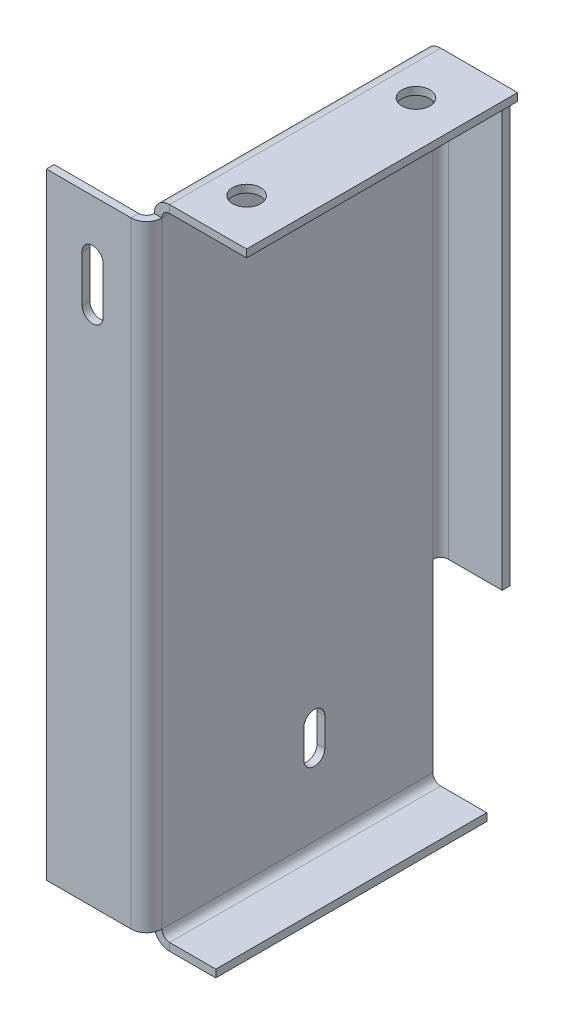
ISO-10303-21;
HEADER;
FILE_DESCRIPTION(('STEP AP214'),'2;1');
FILE_NAME('part.step','',(''),(''),'','','');
FILE_SCHEMA(('AUTOMOTIVE_DESIGN { 1 0 10303 214 1 1 1 1 }'));
ENDSEC;
DATA;
#1=APPLICATION_CONTEXT('core data for automotive mechanical design processes');
#2=APPLICATION_PROTOCOL_DEFINITION('international standard','automotive_design',2000,#1);
#3=PRODUCT_CONTEXT('',#1,'mechanical');
#4=PRODUCT('Part','Part','',(#3));
#5=PRODUCT_RELATED_PRODUCT_CATEGORY('part','',(#4));
#6=PRODUCT_DEFINITION_FORMATION('','',#4);
#7=PRODUCT_DEFINITION_CONTEXT('part definition',#1,'design');
#8=PRODUCT_DEFINITION('design','',#6,#7);
#9=PRODUCT_DEFINITION_SHAPE('','',#8);
#10=(LENGTH_UNIT() NAMED_UNIT(*) SI_UNIT(.MILLI.,.METRE.));
#11=(NAMED_UNIT(*) PLANE_ANGLE_UNIT() SI_UNIT($,.RADIAN.));
#12=(NAMED_UNIT(*) SI_UNIT($,.STERADIAN.) SOLID_ANGLE_UNIT());
#13=UNCERTAINTY_MEASURE_WITH_UNIT(LENGTH_MEASURE(1.E-05),#10,'distance_accuracy_value','');
#14=(GEOMETRIC_REPRESENTATION_CONTEXT(3) GLOBAL_UNCERTAINTY_ASSIGNED_CONTEXT((#13)) GLOBAL_UNIT_ASSIGNED_CONTEXT((#10,
#11,#12)) REPRESENTATION_CONTEXT('',''));
#15=CARTESIAN_POINT('',(0.,0.,0.));
#16=DIRECTION('',(0.,0.,1.));
#17=DIRECTION('',(1.,0.,0.));
#18=AXIS2_PLACEMENT_3D('',#15,#16,#17);
#19=CARTESIAN_POINT('',(0.,210.,88.));
#20=DIRECTION('',(0.,-1.,0.));
#21=DIRECTION('',(0.,0.,-1.));
#22=AXIS2_PLACEMENT_3D('',#19,#20,#21);
#23=PLANE('',#22);
#24=CARTESIAN_POINT('',(15.,210.,18.));
#25=DIRECTION('',(0.,1.,0.));
#26=DIRECTION('',(0.,0.,1.));
#27=AXIS2_PLACEMENT_3D('',#24,#25,#26);
#28=CIRCLE('',#27,4.54999999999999);
#29=CARTESIAN_POINT('',(15.,210.,22.55));
#30=VERTEX_POINT('',#29);
#31=EDGE_CURVE('E691',#30,#30,#28,.T.);
#32=ORIENTED_EDGE('',*,*,#31,.F.);
#33=EDGE_LOOP('',(#32));
#34=FACE_BOUND('',#33,.T.);
#35=DIRECTION('',(-0.999999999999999,0.,0.));
#36=VECTOR('',#35,1.);
#37=CARTESIAN_POINT('',(0.,210.,0.));
#38=LINE('',#37,#36);
#39=CARTESIAN_POINT('',(30.,210.,0.));
#40=VERTEX_POINT('',#39);
#41=CARTESIAN_POINT('',(5.,210.,0.));
#42=VERTEX_POINT('',#41);
#43=EDGE_CURVE('E514',#40,#42,#38,.T.);
#44=ORIENTED_EDGE('',*,*,#43,.T.);
#45=DIRECTION('',(0.,0.,-1.));
#46=VECTOR('',#45,1.);
#47=CARTESIAN_POINT('',(5.,210.,88.));
#48=LINE('',#47,#46);
#49=CARTESIAN_POINT('',(5.,210.,88.));
#50=VERTEX_POINT('',#49);
#51=EDGE_CURVE('E573',#50,#42,#48,.T.);
#52=ORIENTED_EDGE('',*,*,#51,.F.);
#53=DIRECTION('',(-0.999999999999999,0.,0.));
#54=VECTOR('',#53,1.);
#55=CARTESIAN_POINT('',(0.,210.,88.));
#56=LINE('',#55,#54);
#57=CARTESIAN_POINT('',(30.,210.,88.));
#58=VERTEX_POINT('',#57);
#59=EDGE_CURVE('E600',#58,#50,#56,.T.);
#60=ORIENTED_EDGE('',*,*,#59,.F.);
#61=DIRECTION('',(0.,0.,-1.));
#62=VECTOR('',#61,1.);
#63=CARTESIAN_POINT('',(30.,210.,88.));
#64=LINE('',#63,#62);
#65=EDGE_CURVE('E570',#58,#40,#64,.T.);
#66=ORIENTED_EDGE('',*,*,#65,.T.);
#67=EDGE_LOOP('',(#44,#52,#60,#66));
#68=FACE_BOUND('',#67,.T.);
#69=CARTESIAN_POINT('',(15.,210.,73.));
#70=DIRECTION('',(0.,1.,0.));
#71=DIRECTION('',(0.,0.,1.));
#72=AXIS2_PLACEMENT_3D('',#69,#70,#71);
#73=CIRCLE('',#72,4.54999999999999);
#74=CARTESIAN_POINT('',(15.,210.,77.55));
#75=VERTEX_POINT('',#74);
#76=EDGE_CURVE('E680',#75,#75,#73,.T.);
#77=ORIENTED_EDGE('',*,*,#76,.F.);
#78=EDGE_LOOP('',(#77));
#79=FACE_BOUND('',#78,.T.);
#80=ADVANCED_FACE('F80',(#34,#68,#79),#23,.F.);
#81=CARTESIAN_POINT('',(0.,5.,88.));
#82=DIRECTION('',(0.,0.,1.));
#83=DIRECTION('',(0.999999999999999,0.,0.));
#84=AXIS2_PLACEMENT_3D('',#81,#82,#83);
#85=PLANE('',#84);
#86=DIRECTION('',(0.999999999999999,0.,0.));
#87=VECTOR('',#86,1.);
#88=CARTESIAN_POINT('',(0.,5.,88.));
#89=LINE('',#88,#87);
#90=CARTESIAN_POINT('',(0.,5.,88.));
#91=VERTEX_POINT('',#90);
#92=CARTESIAN_POINT('',(2.49999999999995,5.,88.));
#93=VERTEX_POINT('',#92);
#94=EDGE_CURVE('E13',#91,#93,#89,.T.);
#95=ORIENTED_EDGE('',*,*,#94,.F.);
#96=CARTESIAN_POINT('',(4.99999999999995,5.,88.));
#97=DIRECTION('',(0.,0.,1.));
#98=DIRECTION('',(0.999999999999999,0.,0.));
#99=AXIS2_PLACEMENT_3D('',#96,#97,#98);
#100=CIRCLE('',#99,5.);
#101=CARTESIAN_POINT('',(4.99999999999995,0.,88.));
#102=VERTEX_POINT('',#101);
#103=EDGE_CURVE('E589',#91,#102,#100,.T.);
#104=ORIENTED_EDGE('',*,*,#103,.T.);
#105=DIRECTION('',(0.,-1.,0.));
#106=VECTOR('',#105,1.);
#107=CARTESIAN_POINT('',(4.99999999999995,2.49999999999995,88.));
#108=LINE('',#107,#106);
#109=CARTESIAN_POINT('',(4.99999999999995,2.49999999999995,88.));
#110=VERTEX_POINT('',#109);
#111=EDGE_CURVE('E90',#110,#102,#108,.T.);
#112=ORIENTED_EDGE('',*,*,#111,.F.);
#113=CARTESIAN_POINT('',(4.99999999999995,5.,88.));
#114=DIRECTION('',(0.,0.,1.));
#115=DIRECTION('',(0.999999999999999,0.,0.));
#116=AXIS2_PLACEMENT_3D('',#113,#114,#115);
#117=CIRCLE('',#116,2.5);
#118=EDGE_CURVE('E618',#93,#110,#117,.T.);
#119=ORIENTED_EDGE('',*,*,#118,.F.);
#120=EDGE_LOOP('',(#95,#104,#112,#119));
#121=FACE_BOUND('',#120,.T.);
#122=ADVANCED_FACE('F82',(#121),#85,.T.);
#123=CARTESIAN_POINT('',(4.99999999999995,0.,0.));
#124=DIRECTION('',(0.,0.,-1.));
#125=DIRECTION('',(-0.999999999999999,0.,0.));
#126=AXIS2_PLACEMENT_3D('',#123,#124,#125);
#127=PLANE('',#126);
#128=DIRECTION('',(0.,1.,0.));
#129=VECTOR('',#128,1.);
#130=CARTESIAN_POINT('',(4.99999999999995,0.,0.));
#131=LINE('',#130,#129);
#132=CARTESIAN_POINT('',(4.99999999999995,0.,0.));
#133=VERTEX_POINT('',#132);
#134=CARTESIAN_POINT('',(5.,2.49999999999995,0.));
#135=VERTEX_POINT('',#134);
#136=EDGE_CURVE('E530',#133,#135,#131,.T.);
#137=ORIENTED_EDGE('',*,*,#136,.F.);
#138=CARTESIAN_POINT('',(5.,5.,0.));
#139=DIRECTION('',(0.,0.,1.));
#140=DIRECTION('',(0.999999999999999,0.,0.));
#141=AXIS2_PLACEMENT_3D('',#138,#139,#140);
#142=CIRCLE('',#141,5.);
#143=CARTESIAN_POINT('',(0.,5.,0.));
#144=VERTEX_POINT('',#143);
#145=EDGE_CURVE('E523',#144,#133,#142,.T.);
#146=ORIENTED_EDGE('',*,*,#145,.F.);
#147=DIRECTION('',(-0.999999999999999,0.,0.));
#148=VECTOR('',#147,1.);
#149=CARTESIAN_POINT('',(2.5,5.,0.));
#150=LINE('',#149,#148);
#151=CARTESIAN_POINT('',(2.5,5.,0.));
#152=VERTEX_POINT('',#151);
#153=EDGE_CURVE('E533',#152,#144,#150,.T.);
#154=ORIENTED_EDGE('',*,*,#153,.F.);
#155=CARTESIAN_POINT('',(5.,5.,0.));
#156=DIRECTION('',(0.,0.,1.));
#157=DIRECTION('',(0.999999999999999,0.,0.));
#158=AXIS2_PLACEMENT_3D('',#155,#156,#157);
#159=CIRCLE('',#158,2.5);
#160=EDGE_CURVE('E489',#152,#135,#159,.T.);
#161=ORIENTED_EDGE('',*,*,#160,.T.);
#162=EDGE_LOOP('',(#137,#146,#154,#161));
#163=FACE_BOUND('',#162,.T.);
#164=ADVANCED_FACE('F713',(#163),#127,.T.);
#165=CARTESIAN_POINT('',(2.5,5.,0.));
#166=DIRECTION('',(0.,0.,-1.));
#167=DIRECTION('',(-0.999999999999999,0.,0.));
#168=AXIS2_PLACEMENT_3D('',#165,#166,#167);
#169=PLANE('',#168);
#170=DIRECTION('',(0.999999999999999,0.,0.));
#171=VECTOR('',#170,1.);
#172=CARTESIAN_POINT('',(0.,0.,0.));
#173=LINE('',#172,#171);
#174=CARTESIAN_POINT('',(20.,0.,0.));
#175=VERTEX_POINT('',#174);
#176=EDGE_CURVE('E687',#133,#175,#173,.T.);
#177=ORIENTED_EDGE('',*,*,#176,.F.);
#178=ORIENTED_EDGE('',*,*,#136,.T.);
#179=DIRECTION('',(0.999999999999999,0.,0.));
#180=VECTOR('',#179,1.);
#181=CARTESIAN_POINT('',(0.,2.49999999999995,0.));
#182=LINE('',#181,#180);
#183=CARTESIAN_POINT('',(20.,2.49999999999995,0.));
#184=VERTEX_POINT('',#183);
#185=EDGE_CURVE('E494',#135,#184,#182,.T.);
#186=ORIENTED_EDGE('',*,*,#185,.T.);
#187=DIRECTION('',(0.,-1.,0.));
#188=VECTOR('',#187,1.);
#189=CARTESIAN_POINT('',(20.,2.49999999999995,0.));
#190=LINE('',#189,#188);
#191=EDGE_CURVE('E698',#184,#175,#190,.T.);
#192=ORIENTED_EDGE('',*,*,#191,.T.);
#193=EDGE_LOOP('',(#177,#178,#186,#192));
#194=FACE_BOUND('',#193,.T.);
#195=ADVANCED_FACE('F706',(#194),#169,.T.);
#196=CARTESIAN_POINT('',(5.,210.,88.));
#197=DIRECTION('',(0.,0.,1.));
#198=DIRECTION('',(0.999999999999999,0.,0.));
#199=AXIS2_PLACEMENT_3D('',#196,#197,#198);
#200=PLANE('',#199);
#201=DIRECTION('',(0.,-1.,0.));
#202=VECTOR('',#201,1.);
#203=CARTESIAN_POINT('',(5.,210.,88.));
#204=LINE('',#203,#202);
#205=CARTESIAN_POINT('',(5.,207.5,88.));
#206=VERTEX_POINT('',#205);
#207=EDGE_CURVE('E536',#50,#206,#204,.T.);
#208=ORIENTED_EDGE('',*,*,#207,.F.);
#209=CARTESIAN_POINT('',(5.,205.,88.));
#210=DIRECTION('',(0.,0.,1.));
#211=DIRECTION('',(0.999999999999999,0.,0.));
#212=AXIS2_PLACEMENT_3D('',#209,#210,#211);
#213=CIRCLE('',#212,5.);
#214=CARTESIAN_POINT('',(0.,205.,88.));
#215=VERTEX_POINT('',#214);
#216=EDGE_CURVE('E596',#50,#215,#213,.T.);
#217=ORIENTED_EDGE('',*,*,#216,.T.);
#218=DIRECTION('',(-0.999999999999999,0.,0.));
#219=VECTOR('',#218,1.);
#220=CARTESIAN_POINT('',(2.5,205.,88.));
#221=LINE('',#220,#219);
#222=CARTESIAN_POINT('',(2.5,205.,88.));
#223=VERTEX_POINT('',#222);
#224=EDGE_CURVE('E539',#223,#215,#221,.T.);
#225=ORIENTED_EDGE('',*,*,#224,.F.);
#226=CARTESIAN_POINT('',(5.,205.,88.));
#227=DIRECTION('',(0.,0.,1.));
#228=DIRECTION('',(0.999999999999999,0.,0.));
#229=AXIS2_PLACEMENT_3D('',#226,#227,#228);
#230=CIRCLE('',#229,2.5);
#231=EDGE_CURVE('E611',#206,#223,#230,.T.);
#232=ORIENTED_EDGE('',*,*,#231,.F.);
#233=EDGE_LOOP('',(#208,#217,#225,#232));
#234=FACE_BOUND('',#233,.T.);
#235=ADVANCED_FACE('F738',(#234),#200,.T.);
#236=CARTESIAN_POINT('',(2.5,205.,88.));
#237=DIRECTION('',(0.,0.,1.));
#238=DIRECTION('',(0.999999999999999,0.,0.));
#239=AXIS2_PLACEMENT_3D('',#236,#237,#238);
#240=PLANE('',#239);
#241=ORIENTED_EDGE('',*,*,#59,.T.);
#242=ORIENTED_EDGE('',*,*,#207,.T.);
#243=DIRECTION('',(0.999999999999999,0.,0.));
#244=VECTOR('',#243,1.);
#245=CARTESIAN_POINT('',(0.,207.5,88.));
#246=LINE('',#245,#244);
#247=CARTESIAN_POINT('',(30.,207.5,88.));
#248=VERTEX_POINT('',#247);
#249=EDGE_CURVE('E608',#248,#206,#246,.F.);
#250=ORIENTED_EDGE('',*,*,#249,.F.);
#251=DIRECTION('',(0.,-1.,0.));
#252=VECTOR('',#251,1.);
#253=CARTESIAN_POINT('',(30.,210.,88.));
#254=LINE('',#253,#252);
#255=EDGE_CURVE('E604',#58,#248,#254,.T.);
#256=ORIENTED_EDGE('',*,*,#255,.F.);
#257=EDGE_LOOP('',(#241,#242,#250,#256));
#258=FACE_BOUND('',#257,.T.);
#259=ADVANCED_FACE('F669',(#258),#240,.T.);
#260=CARTESIAN_POINT('',(0.,205.,0.));
#261=DIRECTION('',(0.,0.,-1.));
#262=DIRECTION('',(-0.999999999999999,0.,0.));
#263=AXIS2_PLACEMENT_3D('',#260,#261,#262);
#264=PLANE('',#263);
#265=DIRECTION('',(0.999999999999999,0.,0.));
#266=VECTOR('',#265,1.);
#267=CARTESIAN_POINT('',(0.,205.,0.));
#268=LINE('',#267,#266);
#269=CARTESIAN_POINT('',(0.,205.,0.));
#270=VERTEX_POINT('',#269);
#271=CARTESIAN_POINT('',(2.5,205.,0.));
#272=VERTEX_POINT('',#271);
#273=EDGE_CURVE('E542',#270,#272,#268,.T.);
#274=ORIENTED_EDGE('',*,*,#273,.F.);
#275=CARTESIAN_POINT('',(5.,205.,0.));
#276=DIRECTION('',(0.,0.,1.));
#277=DIRECTION('',(0.999999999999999,0.,0.));
#278=AXIS2_PLACEMENT_3D('',#275,#276,#277);
#279=CIRCLE('',#278,5.);
#280=EDGE_CURVE('E518',#42,#270,#279,.T.);
#281=ORIENTED_EDGE('',*,*,#280,.F.);
#282=DIRECTION('',(0.,1.,0.));
#283=VECTOR('',#282,1.);
#284=CARTESIAN_POINT('',(5.,207.5,0.));
#285=LINE('',#284,#283);
#286=CARTESIAN_POINT('',(5.,207.5,0.));
#287=VERTEX_POINT('',#286);
#288=EDGE_CURVE('E545',#287,#42,#285,.T.);
#289=ORIENTED_EDGE('',*,*,#288,.F.);
#290=CARTESIAN_POINT('',(5.,205.,0.));
#291=DIRECTION('',(0.,0.,1.));
#292=DIRECTION('',(0.999999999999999,0.,0.));
#293=AXIS2_PLACEMENT_3D('',#290,#291,#292);
#294=CIRCLE('',#293,2.5);
#295=EDGE_CURVE('E491',#287,#272,#294,.T.);
#296=ORIENTED_EDGE('',*,*,#295,.T.);
#297=EDGE_LOOP('',(#274,#281,#289,#296));
#298=FACE_BOUND('',#297,.T.);
#299=ADVANCED_FACE('F653',(#298),#264,.T.);
#300=CARTESIAN_POINT('',(5.,207.5,0.));
#301=DIRECTION('',(0.,0.,-1.));
#302=DIRECTION('',(-0.999999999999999,0.,0.));
#303=AXIS2_PLACEMENT_3D('',#300,#301,#302);
#304=PLANE('',#303);
#305=DIRECTION('',(-0.999999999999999,0.,0.));
#306=VECTOR('',#305,1.);
#307=CARTESIAN_POINT('',(2.49999999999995,64.9999999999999,0.));
#308=LINE('',#307,#306);
#309=CARTESIAN_POINT('',(2.5,64.9999999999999,0.));
#310=VERTEX_POINT('',#309);
#311=CARTESIAN_POINT('',(0.,64.9999999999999,0.));
#312=VERTEX_POINT('',#311);
#313=EDGE_CURVE('E421',#310,#312,#308,.T.);
#314=ORIENTED_EDGE('',*,*,#313,.F.);
#315=DIRECTION('',(0.,1.,0.));
#316=VECTOR('',#315,1.);
#317=CARTESIAN_POINT('',(2.49999999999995,0.,0.));
#318=LINE('',#317,#316);
#319=EDGE_CURVE('E478',#310,#152,#318,.F.);
#320=ORIENTED_EDGE('',*,*,#319,.T.);
#321=ORIENTED_EDGE('',*,*,#153,.T.);
#322=DIRECTION('',(0.,-1.,0.));
#323=VECTOR('',#322,1.);
#324=CARTESIAN_POINT('',(0.,0.,0.));
#325=LINE('',#324,#323);
#326=EDGE_CURVE('E480',#312,#144,#325,.T.);
#327=ORIENTED_EDGE('',*,*,#326,.F.);
#328=EDGE_LOOP('',(#314,#320,#321,#327));
#329=FACE_BOUND('',#328,.T.);
#330=ADVANCED_FACE('F476',(#329),#304,.T.);
#331=CARTESIAN_POINT('',(0.,0.,88.));
#332=DIRECTION('',(0.,1.,0.));
#333=DIRECTION('',(0.,0.,1.));
#334=AXIS2_PLACEMENT_3D('',#331,#332,#333);
#335=PLANE('',#334);
#336=ORIENTED_EDGE('',*,*,#176,.T.);
#337=DIRECTION('',(0.,0.,-1.));
#338=VECTOR('',#337,1.);
#339=CARTESIAN_POINT('',(19.9999999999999,0.,88.));
#340=LINE('',#339,#338);
#341=CARTESIAN_POINT('',(19.9999999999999,0.,88.));
#342=VERTEX_POINT('',#341);
#343=EDGE_CURVE('E548',#342,#175,#340,.T.);
#344=ORIENTED_EDGE('',*,*,#343,.F.);
#345=DIRECTION('',(0.999999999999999,0.,0.));
#346=VECTOR('',#345,1.);
#347=CARTESIAN_POINT('',(0.,0.,88.));
#348=LINE('',#347,#346);
#349=EDGE_CURVE('E628',#102,#342,#348,.T.);
#350=ORIENTED_EDGE('',*,*,#349,.F.);
#351=DIRECTION('',(0.,0.,-1.));
#352=VECTOR('',#351,1.);
#353=CARTESIAN_POINT('',(4.99999999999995,0.,88.));
#354=LINE('',#353,#352);
#355=EDGE_CURVE('E585',#102,#133,#354,.T.);
#356=ORIENTED_EDGE('',*,*,#355,.T.);
#357=EDGE_LOOP('',(#336,#344,#350,#356));
#358=FACE_BOUND('',#357,.T.);
#359=ADVANCED_FACE('F807',(#358),#335,.F.);
#360=CARTESIAN_POINT('',(19.9999999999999,2.49999999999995,88.));
#361=DIRECTION('',(0.999999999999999,0.,0.));
#362=DIRECTION('',(0.,0.,-1.));
#363=AXIS2_PLACEMENT_3D('',#360,#361,#362);
#364=PLANE('',#363);
#365=ORIENTED_EDGE('',*,*,#191,.F.);
#366=DIRECTION('',(0.,0.,-1.));
#367=VECTOR('',#366,1.);
#368=CARTESIAN_POINT('',(19.9999999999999,2.49999999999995,88.));
#369=LINE('',#368,#367);
#370=CARTESIAN_POINT('',(19.9999999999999,2.49999999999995,88.));
#371=VERTEX_POINT('',#370);
#372=EDGE_CURVE('E551',#371,#184,#369,.T.);
#373=ORIENTED_EDGE('',*,*,#372,.F.);
#374=DIRECTION('',(0.,-1.,0.));
#375=VECTOR('',#374,1.);
#376=CARTESIAN_POINT('',(19.9999999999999,2.49999999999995,88.));
#377=LINE('',#376,#375);
#378=EDGE_CURVE('E625',#371,#342,#377,.T.);
#379=ORIENTED_EDGE('',*,*,#378,.T.);
#380=ORIENTED_EDGE('',*,*,#343,.T.);
#381=EDGE_LOOP('',(#365,#373,#379,#380));
#382=FACE_BOUND('',#381,.T.);
#383=ADVANCED_FACE('F817',(#382),#364,.T.);
#384=CARTESIAN_POINT('',(0.,2.49999999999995,88.));
#385=DIRECTION('',(0.,1.,0.));
#386=DIRECTION('',(0.,0.,1.));
#387=AXIS2_PLACEMENT_3D('',#384,#385,#386);
#388=PLANE('',#387);
#389=ORIENTED_EDGE('',*,*,#185,.F.);
#390=DIRECTION('',(0.,0.,-1.));
#391=VECTOR('',#390,1.);
#392=CARTESIAN_POINT('',(4.99999999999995,2.49999999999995,88.));
#393=LINE('',#392,#391);
#394=EDGE_CURVE('E554',#110,#135,#393,.T.);
#395=ORIENTED_EDGE('',*,*,#394,.F.);
#396=DIRECTION('',(0.999999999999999,0.,0.));
#397=VECTOR('',#396,1.);
#398=CARTESIAN_POINT('',(0.,2.49999999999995,88.));
#399=LINE('',#398,#397);
#400=EDGE_CURVE('E622',#110,#371,#399,.T.);
#401=ORIENTED_EDGE('',*,*,#400,.T.);
#402=ORIENTED_EDGE('',*,*,#372,.T.);
#403=EDGE_LOOP('',(#389,#395,#401,#402));
#404=FACE_BOUND('',#403,.T.);
#405=ADVANCED_FACE('F710',(#404),#388,.T.);
#406=CARTESIAN_POINT('',(4.99999999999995,5.,88.));
#407=DIRECTION('',(0.,0.,-1.));
#408=DIRECTION('',(-0.999999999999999,0.,0.));
#409=AXIS2_PLACEMENT_3D('',#406,#407,#408);
#410=CYLINDRICAL_SURFACE('',#409,2.5);
#411=ORIENTED_EDGE('',*,*,#160,.F.);
#412=DIRECTION('',(0.,0.,-1.));
#413=VECTOR('',#412,1.);
#414=CARTESIAN_POINT('',(2.49999999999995,5.,88.));
#415=LINE('',#414,#413);
#416=EDGE_CURVE('E486',#93,#152,#415,.T.);
#417=ORIENTED_EDGE('',*,*,#416,.F.);
#418=ORIENTED_EDGE('',*,*,#118,.T.);
#419=ORIENTED_EDGE('',*,*,#394,.T.);
#420=EDGE_LOOP('',(#411,#417,#418,#419));
#421=FACE_BOUND('',#420,.T.);
#422=ADVANCED_FACE('F715',(#421),#410,.F.);
#423=CARTESIAN_POINT('',(2.49999999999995,0.,88.));
#424=DIRECTION('',(0.999999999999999,0.,0.));
#425=DIRECTION('',(0.,0.,-1.));
#426=AXIS2_PLACEMENT_3D('',#423,#424,#425);
#427=PLANE('',#426);
#428=CARTESIAN_POINT('',(2.5,38.6,38.5));
#429=DIRECTION('',(0.999999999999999,0.,0.));
#430=DIRECTION('',(0.,0.,-1.));
#431=AXIS2_PLACEMENT_3D('',#428,#429,#430);
#432=CIRCLE('',#431,3.4);
#433=CARTESIAN_POINT('',(2.5,38.6,41.9));
#434=VERTEX_POINT('',#433);
#435=CARTESIAN_POINT('',(2.5,38.6,35.1));
#436=VERTEX_POINT('',#435);
#437=EDGE_CURVE('E285',#434,#436,#432,.F.);
#438=ORIENTED_EDGE('',*,*,#437,.T.);
#439=DIRECTION('',(0.,-1.,0.));
#440=VECTOR('',#439,1.);
#441=CARTESIAN_POINT('',(2.5,38.6,35.1));
#442=LINE('',#441,#440);
#443=CARTESIAN_POINT('',(2.5,29.4,35.1));
#444=VERTEX_POINT('',#443);
#445=EDGE_CURVE('E273',#436,#444,#442,.T.);
#446=ORIENTED_EDGE('',*,*,#445,.T.);
#447=CARTESIAN_POINT('',(2.5,29.4,38.5));
#448=DIRECTION('',(0.999999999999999,0.,0.));
#449=DIRECTION('',(0.,0.,-1.));
#450=AXIS2_PLACEMENT_3D('',#447,#448,#449);
#451=CIRCLE('',#450,3.4);
#452=CARTESIAN_POINT('',(2.5,29.4,41.9));
#453=VERTEX_POINT('',#452);
#454=EDGE_CURVE('E302',#444,#453,#451,.F.);
#455=ORIENTED_EDGE('',*,*,#454,.T.);
#456=DIRECTION('',(0.,1.,0.));
#457=VECTOR('',#456,1.);
#458=CARTESIAN_POINT('',(2.5,38.6,41.9));
#459=LINE('',#458,#457);
#460=EDGE_CURVE('E293',#453,#434,#459,.T.);
#461=ORIENTED_EDGE('',*,*,#460,.T.);
#462=EDGE_LOOP('',(#438,#446,#455,#461));
#463=FACE_BOUND('',#462,.T.);
#464=EDGE_CURVE('E427',#272,#310,#318,.F.);
#465=ORIENTED_EDGE('',*,*,#464,.F.);
#466=DIRECTION('',(0.,0.,-1.));
#467=VECTOR('',#466,1.);
#468=CARTESIAN_POINT('',(2.5,205.,88.));
#469=LINE('',#468,#467);
#470=EDGE_CURVE('E560',#223,#272,#469,.T.);
#471=ORIENTED_EDGE('',*,*,#470,.F.);
#472=DIRECTION('',(0.,1.,0.));
#473=VECTOR('',#472,1.);
#474=CARTESIAN_POINT('',(2.49999999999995,0.,88.));
#475=LINE('',#474,#473);
#476=EDGE_CURVE('E615',#223,#93,#475,.F.);
#477=ORIENTED_EDGE('',*,*,#476,.T.);
#478=ORIENTED_EDGE('',*,*,#416,.T.);
#479=ORIENTED_EDGE('',*,*,#319,.F.);
#480=EDGE_LOOP('',(#465,#471,#477,#478,#479));
#481=FACE_BOUND('',#480,.T.);
#482=ADVANCED_FACE('F291',(#463,#481),#427,.T.);
#483=CARTESIAN_POINT('',(5.,205.,88.));
#484=DIRECTION('',(0.,0.,-1.));
#485=DIRECTION('',(-0.999999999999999,0.,0.));
#486=AXIS2_PLACEMENT_3D('',#483,#484,#485);
#487=CYLINDRICAL_SURFACE('',#486,2.5);
#488=ORIENTED_EDGE('',*,*,#295,.F.);
#489=DIRECTION('',(0.,0.,-1.));
#490=VECTOR('',#489,1.);
#491=CARTESIAN_POINT('',(5.,207.5,88.));
#492=LINE('',#491,#490);
#493=EDGE_CURVE('E563',#206,#287,#492,.T.);
#494=ORIENTED_EDGE('',*,*,#493,.F.);
#495=ORIENTED_EDGE('',*,*,#231,.T.);
#496=ORIENTED_EDGE('',*,*,#470,.T.);
#497=EDGE_LOOP('',(#488,#494,#495,#496));
#498=FACE_BOUND('',#497,.T.);
#499=ADVANCED_FACE('F657',(#498),#487,.F.);
#500=CARTESIAN_POINT('',(0.,207.5,88.));
#501=DIRECTION('',(0.,-1.,0.));
#502=DIRECTION('',(0.,0.,-1.));
#503=AXIS2_PLACEMENT_3D('',#500,#501,#502);
#504=PLANE('',#503);
#505=CARTESIAN_POINT('',(14.9999999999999,207.5,18.));
#506=DIRECTION('',(0.,-1.,0.));
#507=DIRECTION('',(0.,0.,-1.));
#508=AXIS2_PLACEMENT_3D('',#505,#506,#507);
#509=CIRCLE('',#508,4.54999999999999);
#510=CARTESIAN_POINT('',(14.9999999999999,207.5,13.45));
#511=VERTEX_POINT('',#510);
#512=EDGE_CURVE('E684',#511,#511,#509,.T.);
#513=ORIENTED_EDGE('',*,*,#512,.F.);
#514=EDGE_LOOP('',(#513));
#515=FACE_BOUND('',#514,.T.);
#516=CARTESIAN_POINT('',(15.,207.5,73.));
#517=DIRECTION('',(0.,-1.,0.));
#518=DIRECTION('',(0.,0.,-1.));
#519=AXIS2_PLACEMENT_3D('',#516,#517,#518);
#520=CIRCLE('',#519,4.54999999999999);
#521=CARTESIAN_POINT('',(15.,207.5,68.45));
#522=VERTEX_POINT('',#521);
#523=EDGE_CURVE('E683',#522,#522,#520,.T.);
#524=ORIENTED_EDGE('',*,*,#523,.F.);
#525=EDGE_LOOP('',(#524));
#526=FACE_BOUND('',#525,.T.);
#527=DIRECTION('',(0.999999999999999,0.,0.));
#528=VECTOR('',#527,1.);
#529=CARTESIAN_POINT('',(0.,207.5,0.));
#530=LINE('',#529,#528);
#531=CARTESIAN_POINT('',(30.,207.5,0.));
#532=VERTEX_POINT('',#531);
#533=EDGE_CURVE('E506',#532,#287,#530,.F.);
#534=ORIENTED_EDGE('',*,*,#533,.F.);
#535=DIRECTION('',(0.,0.,-1.));
#536=VECTOR('',#535,1.);
#537=CARTESIAN_POINT('',(30.,207.5,88.));
#538=LINE('',#537,#536);
#539=EDGE_CURVE('E567',#248,#532,#538,.T.);
#540=ORIENTED_EDGE('',*,*,#539,.F.);
#541=ORIENTED_EDGE('',*,*,#249,.T.);
#542=ORIENTED_EDGE('',*,*,#493,.T.);
#543=EDGE_LOOP('',(#534,#540,#541,#542));
#544=FACE_BOUND('',#543,.T.);
#545=ADVANCED_FACE('F665',(#515,#526,#544),#504,.T.);
#546=CARTESIAN_POINT('',(30.,210.,88.));
#547=DIRECTION('',(0.999999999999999,0.,0.));
#548=DIRECTION('',(0.,0.,-1.));
#549=AXIS2_PLACEMENT_3D('',#546,#547,#548);
#550=PLANE('',#549);
#551=DIRECTION('',(0.,-1.,0.));
#552=VECTOR('',#551,1.);
#553=CARTESIAN_POINT('',(30.,210.,0.));
#554=LINE('',#553,#552);
#555=EDGE_CURVE('E510',#40,#532,#554,.T.);
#556=ORIENTED_EDGE('',*,*,#555,.F.);
#557=ORIENTED_EDGE('',*,*,#65,.F.);
#558=ORIENTED_EDGE('',*,*,#255,.T.);
#559=ORIENTED_EDGE('',*,*,#539,.T.);
#560=EDGE_LOOP('',(#556,#557,#558,#559));
#561=FACE_BOUND('',#560,.T.);
#562=ADVANCED_FACE('F671',(#561),#550,.T.);
#563=CARTESIAN_POINT('',(5.,205.,88.));
#564=DIRECTION('',(0.,0.,-1.));
#565=DIRECTION('',(-0.999999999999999,0.,0.));
#566=AXIS2_PLACEMENT_3D('',#563,#564,#565);
#567=CYLINDRICAL_SURFACE('',#566,5.);
#568=ORIENTED_EDGE('',*,*,#280,.T.);
#569=DIRECTION('',(0.,0.,-1.));
#570=VECTOR('',#569,1.);
#571=CARTESIAN_POINT('',(0.,205.,88.));
#572=LINE('',#571,#570);
#573=EDGE_CURVE('E577',#215,#270,#572,.T.);
#574=ORIENTED_EDGE('',*,*,#573,.F.);
#575=ORIENTED_EDGE('',*,*,#216,.F.);
#576=ORIENTED_EDGE('',*,*,#51,.T.);
#577=EDGE_LOOP('',(#568,#574,#575,#576));
#578=FACE_BOUND('',#577,.T.);
#579=ADVANCED_FACE('F649',(#578),#567,.T.);
#580=CARTESIAN_POINT('',(0.,0.,88.));
#581=DIRECTION('',(0.999999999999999,0.,0.));
#582=DIRECTION('',(0.,0.,-1.));
#583=AXIS2_PLACEMENT_3D('',#580,#581,#582);
#584=PLANE('',#583);
#585=DIRECTION('',(0.,-1.,0.));
#586=VECTOR('',#585,1.);
#587=CARTESIAN_POINT('',(0.,38.6,35.1));
#588=LINE('',#587,#586);
#589=CARTESIAN_POINT('',(0.,38.6,35.1));
#590=VERTEX_POINT('',#589);
#591=CARTESIAN_POINT('',(0.,29.4,35.1));
#592=VERTEX_POINT('',#591);
#593=EDGE_CURVE('E299',#590,#592,#588,.T.);
#594=ORIENTED_EDGE('',*,*,#593,.F.);
#595=CARTESIAN_POINT('',(0.,38.6,38.5));
#596=DIRECTION('',(-0.999999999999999,0.,0.));
#597=DIRECTION('',(0.,0.,-1.));
#598=AXIS2_PLACEMENT_3D('',#595,#596,#597);
#599=CIRCLE('',#598,3.4);
#600=CARTESIAN_POINT('',(0.,38.6,41.9));
#601=VERTEX_POINT('',#600);
#602=EDGE_CURVE('E106',#601,#590,#599,.T.);
#603=ORIENTED_EDGE('',*,*,#602,.F.);
#604=DIRECTION('',(0.,1.,0.));
#605=VECTOR('',#604,1.);
#606=CARTESIAN_POINT('',(0.,38.6,41.9));
#607=LINE('',#606,#605);
#608=CARTESIAN_POINT('',(0.,29.4,41.9));
#609=VERTEX_POINT('',#608);
#610=EDGE_CURVE('E288',#609,#601,#607,.T.);
#611=ORIENTED_EDGE('',*,*,#610,.F.);
#612=CARTESIAN_POINT('',(0.,29.4,38.5));
#613=DIRECTION('',(-0.999999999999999,0.,0.));
#614=DIRECTION('',(0.,0.,1.));
#615=AXIS2_PLACEMENT_3D('',#612,#613,#614);
#616=CIRCLE('',#615,3.4);
#617=EDGE_CURVE('E308',#592,#609,#616,.T.);
#618=ORIENTED_EDGE('',*,*,#617,.F.);
#619=EDGE_LOOP('',(#594,#603,#611,#618));
#620=FACE_BOUND('',#619,.T.);
#621=EDGE_CURVE('E497',#270,#312,#325,.T.);
#622=ORIENTED_EDGE('',*,*,#621,.T.);
#623=ORIENTED_EDGE('',*,*,#326,.T.);
#624=DIRECTION('',(0.,0.,-1.));
#625=VECTOR('',#624,1.);
#626=CARTESIAN_POINT('',(0.,5.,88.));
#627=LINE('',#626,#625);
#628=EDGE_CURVE('E581',#91,#144,#627,.T.);
#629=ORIENTED_EDGE('',*,*,#628,.F.);
#630=DIRECTION('',(0.,-1.,0.));
#631=VECTOR('',#630,1.);
#632=CARTESIAN_POINT('',(0.,0.,88.));
#633=LINE('',#632,#631);
#634=EDGE_CURVE('E593',#215,#91,#633,.T.);
#635=ORIENTED_EDGE('',*,*,#634,.F.);
#636=ORIENTED_EDGE('',*,*,#573,.T.);
#637=EDGE_LOOP('',(#622,#623,#629,#635,#636));
#638=FACE_BOUND('',#637,.T.);
#639=ADVANCED_FACE('F643',(#620,#638),#584,.F.);
#640=CARTESIAN_POINT('',(4.99999999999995,5.,88.));
#641=DIRECTION('',(0.,0.,-1.));
#642=DIRECTION('',(-0.999999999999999,0.,0.));
#643=AXIS2_PLACEMENT_3D('',#640,#641,#642);
#644=CYLINDRICAL_SURFACE('',#643,5.);
#645=ORIENTED_EDGE('',*,*,#145,.T.);
#646=ORIENTED_EDGE('',*,*,#355,.F.);
#647=ORIENTED_EDGE('',*,*,#103,.F.);
#648=ORIENTED_EDGE('',*,*,#628,.T.);
#649=EDGE_LOOP('',(#645,#646,#647,#648));
#650=FACE_BOUND('',#649,.T.);
#651=ADVANCED_FACE('F902',(#650),#644,.T.);
#652=CARTESIAN_POINT('',(4.99999999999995,5.,88.));
#653=DIRECTION('',(0.,0.,1.));
#654=DIRECTION('',(0.999999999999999,0.,0.));
#655=AXIS2_PLACEMENT_3D('',#652,#653,#654);
#656=PLANE('',#655);
#657=ORIENTED_EDGE('',*,*,#349,.T.);
#658=ORIENTED_EDGE('',*,*,#378,.F.);
#659=ORIENTED_EDGE('',*,*,#400,.F.);
#660=ORIENTED_EDGE('',*,*,#111,.T.);
#661=EDGE_LOOP('',(#657,#658,#659,#660));
#662=FACE_BOUND('',#661,.T.);
#663=ADVANCED_FACE('F913',(#662),#656,.T.);
#664=CARTESIAN_POINT('',(5.,5.,0.));
#665=DIRECTION('',(0.,0.,1.));
#666=DIRECTION('',(0.999999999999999,0.,0.));
#667=AXIS2_PLACEMENT_3D('',#664,#665,#666);
#668=PLANE('',#667);
#669=ORIENTED_EDGE('',*,*,#533,.T.);
#670=ORIENTED_EDGE('',*,*,#288,.T.);
#671=ORIENTED_EDGE('',*,*,#43,.F.);
#672=ORIENTED_EDGE('',*,*,#555,.T.);
#673=EDGE_LOOP('',(#669,#670,#671,#672));
#674=FACE_BOUND('',#673,.T.);
#675=ADVANCED_FACE('F661',(#674),#668,.F.);
#676=CARTESIAN_POINT('',(15.,210.,73.));
#677=DIRECTION('',(0.,1.,0.));
#678=DIRECTION('',(0.,0.,1.));
#679=AXIS2_PLACEMENT_3D('',#676,#677,#678);
#680=CYLINDRICAL_SURFACE('',#679,4.54999999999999);
#681=ORIENTED_EDGE('',*,*,#76,.T.);
#682=EDGE_LOOP('',(#681));
#683=FACE_BOUND('',#682,.T.);
#684=ORIENTED_EDGE('',*,*,#523,.T.);
#685=EDGE_LOOP('',(#684));
#686=FACE_BOUND('',#685,.T.);
#687=ADVANCED_FACE('F932',(#683,#686),#680,.F.);
#688=CARTESIAN_POINT('',(15.,210.,18.));
#689=DIRECTION('',(0.,1.,0.));
#690=DIRECTION('',(0.,0.,1.));
#691=AXIS2_PLACEMENT_3D('',#688,#689,#690);
#692=CYLINDRICAL_SURFACE('',#691,4.54999999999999);
#693=ORIENTED_EDGE('',*,*,#31,.T.);
#694=EDGE_LOOP('',(#693));
#695=FACE_BOUND('',#694,.T.);
#696=ORIENTED_EDGE('',*,*,#512,.T.);
#697=EDGE_LOOP('',(#696));
#698=FACE_BOUND('',#697,.T.);
#699=ADVANCED_FACE('F942',(#695,#698),#692,.F.);
#700=CARTESIAN_POINT('',(-2.50000000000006,5.,88.));
#701=DIRECTION('',(0.,-1.,0.));
#702=DIRECTION('',(0.,0.,-1.));
#703=AXIS2_PLACEMENT_3D('',#700,#701,#702);
#704=PLANE('',#703);
#705=DIRECTION('',(0.,0.,-1.));
#706=VECTOR('',#705,1.);
#707=CARTESIAN_POINT('',(-2.49999999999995,5.,93.));
#708=LINE('',#707,#706);
#709=CARTESIAN_POINT('',(-2.49999999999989,5.,90.5));
#710=VERTEX_POINT('',#709);
#711=CARTESIAN_POINT('',(-2.49999999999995,5.,93.));
#712=VERTEX_POINT('',#711);
#713=EDGE_CURVE('E426',#710,#712,#708,.F.);
#714=ORIENTED_EDGE('',*,*,#713,.F.);
#715=CARTESIAN_POINT('',(-2.50000000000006,5.,88.));
#716=DIRECTION('',(0.,1.,0.));
#717=DIRECTION('',(0.,0.,1.));
#718=AXIS2_PLACEMENT_3D('',#715,#716,#717);
#719=CIRCLE('',#718,2.5);
#720=EDGE_CURVE('E735',#91,#710,#719,.F.);
#721=ORIENTED_EDGE('',*,*,#720,.F.);
#722=ORIENTED_EDGE('',*,*,#94,.T.);
#723=CARTESIAN_POINT('',(-2.50000000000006,5.,88.));
#724=DIRECTION('',(0.,1.,0.));
#725=DIRECTION('',(0.,0.,1.));
#726=AXIS2_PLACEMENT_3D('',#723,#724,#725);
#727=CIRCLE('',#726,5.);
#728=EDGE_CURVE('E725',#93,#712,#727,.F.);
#729=ORIENTED_EDGE('',*,*,#728,.T.);
#730=EDGE_LOOP('',(#714,#721,#722,#729));
#731=FACE_BOUND('',#730,.T.);
#732=ADVANCED_FACE('F951',(#731),#704,.T.);
#733=CARTESIAN_POINT('',(-2.5,205.,88.));
#734=DIRECTION('',(0.,-1.,0.));
#735=DIRECTION('',(0.,0.,-1.));
#736=AXIS2_PLACEMENT_3D('',#733,#734,#735);
#737=PLANE('',#736);
#738=CARTESIAN_POINT('',(-2.5,205.,88.));
#739=DIRECTION('',(0.,1.,0.));
#740=DIRECTION('',(0.,0.,1.));
#741=AXIS2_PLACEMENT_3D('',#738,#739,#740);
#742=CIRCLE('',#741,2.5);
#743=CARTESIAN_POINT('',(-2.49999999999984,205.,90.5));
#744=VERTEX_POINT('',#743);
#745=EDGE_CURVE('E1327',#744,#215,#742,.T.);
#746=ORIENTED_EDGE('',*,*,#745,.F.);
#747=DIRECTION('',(0.,0.,-1.));
#748=VECTOR('',#747,1.);
#749=CARTESIAN_POINT('',(-2.49999999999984,205.,90.5));
#750=LINE('',#749,#748);
#751=CARTESIAN_POINT('',(-2.49999999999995,205.,93.));
#752=VERTEX_POINT('',#751);
#753=EDGE_CURVE('E732',#744,#752,#750,.F.);
#754=ORIENTED_EDGE('',*,*,#753,.T.);
#755=CARTESIAN_POINT('',(-2.5,205.,88.));
#756=DIRECTION('',(0.,1.,0.));
#757=DIRECTION('',(0.,0.,1.));
#758=AXIS2_PLACEMENT_3D('',#755,#756,#757);
#759=CIRCLE('',#758,5.);
#760=EDGE_CURVE('E722',#752,#223,#759,.T.);
#761=ORIENTED_EDGE('',*,*,#760,.T.);
#762=ORIENTED_EDGE('',*,*,#224,.T.);
#763=EDGE_LOOP('',(#746,#754,#761,#762));
#764=FACE_BOUND('',#763,.T.);
#765=ADVANCED_FACE('F729',(#764),#737,.F.);
#766=CARTESIAN_POINT('',(-2.5,205.,88.));
#767=DIRECTION('',(0.,1.,0.));
#768=DIRECTION('',(0.,0.,1.));
#769=AXIS2_PLACEMENT_3D('',#766,#767,#768);
#770=CYLINDRICAL_SURFACE('',#769,5.);
#771=ORIENTED_EDGE('',*,*,#476,.F.);
#772=ORIENTED_EDGE('',*,*,#760,.F.);
#773=DIRECTION('',(0.,1.,0.));
#774=VECTOR('',#773,1.);
#775=CARTESIAN_POINT('',(-2.49999999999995,5.,93.));
#776=LINE('',#775,#774);
#777=EDGE_CURVE('E1315',#752,#712,#776,.F.);
#778=ORIENTED_EDGE('',*,*,#777,.T.);
#779=ORIENTED_EDGE('',*,*,#728,.F.);
#780=EDGE_LOOP('',(#771,#772,#778,#779));
#781=FACE_BOUND('',#780,.T.);
#782=ADVANCED_FACE('F721',(#781),#770,.T.);
#783=CARTESIAN_POINT('',(-2.5,205.,88.));
#784=DIRECTION('',(0.,1.,0.));
#785=DIRECTION('',(0.,0.,1.));
#786=AXIS2_PLACEMENT_3D('',#783,#784,#785);
#787=CYLINDRICAL_SURFACE('',#786,2.5);
#788=ORIENTED_EDGE('',*,*,#634,.T.);
#789=ORIENTED_EDGE('',*,*,#720,.T.);
#790=DIRECTION('',(0.,1.,0.));
#791=VECTOR('',#790,1.);
#792=CARTESIAN_POINT('',(-2.49999999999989,5.,90.5));
#793=LINE('',#792,#791);
#794=EDGE_CURVE('E1318',#710,#744,#793,.T.);
#795=ORIENTED_EDGE('',*,*,#794,.T.);
#796=ORIENTED_EDGE('',*,*,#745,.T.);
#797=EDGE_LOOP('',(#788,#789,#795,#796));
#798=FACE_BOUND('',#797,.T.);
#799=ADVANCED_FACE('F971',(#798),#787,.F.);
#800=CARTESIAN_POINT('',(-30.,205.,93.0000000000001));
#801=DIRECTION('',(0.,-1.,0.));
#802=DIRECTION('',(0.,0.,-1.));
#803=AXIS2_PLACEMENT_3D('',#800,#801,#802);
#804=PLANE('',#803);
#805=ORIENTED_EDGE('',*,*,#753,.F.);
#806=DIRECTION('',(0.999999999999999,0.,0.));
#807=VECTOR('',#806,1.);
#808=CARTESIAN_POINT('',(-29.9999999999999,205.,90.5000000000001));
#809=LINE('',#808,#807);
#810=CARTESIAN_POINT('',(-29.9999999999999,205.,90.5000000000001));
#811=VERTEX_POINT('',#810);
#812=EDGE_CURVE('E1312',#744,#811,#809,.F.);
#813=ORIENTED_EDGE('',*,*,#812,.T.);
#814=DIRECTION('',(0.,0.,-1.));
#815=VECTOR('',#814,1.);
#816=CARTESIAN_POINT('',(-30.,205.,93.0000000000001));
#817=LINE('',#816,#815);
#818=CARTESIAN_POINT('',(-30.,205.,93.0000000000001));
#819=VERTEX_POINT('',#818);
#820=EDGE_CURVE('E418',#819,#811,#817,.T.);
#821=ORIENTED_EDGE('',*,*,#820,.F.);
#822=DIRECTION('',(-0.999999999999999,0.,0.));
#823=VECTOR('',#822,1.);
#824=CARTESIAN_POINT('',(0.,205.,93.));
#825=LINE('',#824,#823);
#826=EDGE_CURVE('E1300',#752,#819,#825,.T.);
#827=ORIENTED_EDGE('',*,*,#826,.F.);
#828=EDGE_LOOP('',(#805,#813,#821,#827));
#829=FACE_BOUND('',#828,.T.);
#830=ADVANCED_FACE('F989',(#829),#804,.F.);
#831=CARTESIAN_POINT('',(0.,5.,93.));
#832=DIRECTION('',(0.,1.,0.));
#833=DIRECTION('',(0.,0.,1.));
#834=AXIS2_PLACEMENT_3D('',#831,#832,#833);
#835=PLANE('',#834);
#836=ORIENTED_EDGE('',*,*,#713,.T.);
#837=DIRECTION('',(0.999999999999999,0.,0.));
#838=VECTOR('',#837,1.);
#839=CARTESIAN_POINT('',(0.,5.,93.));
#840=LINE('',#839,#838);
#841=CARTESIAN_POINT('',(-30.,5.,93.0000000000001));
#842=VERTEX_POINT('',#841);
#843=EDGE_CURVE('E1290',#842,#712,#840,.T.);
#844=ORIENTED_EDGE('',*,*,#843,.F.);
#845=DIRECTION('',(0.,0.,-1.));
#846=VECTOR('',#845,1.);
#847=CARTESIAN_POINT('',(-30.,5.,93.0000000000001));
#848=LINE('',#847,#846);
#849=CARTESIAN_POINT('',(-29.9999999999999,5.,90.5000000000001));
#850=VERTEX_POINT('',#849);
#851=EDGE_CURVE('E1292',#842,#850,#848,.T.);
#852=ORIENTED_EDGE('',*,*,#851,.T.);
#853=DIRECTION('',(-0.999999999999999,0.,0.));
#854=VECTOR('',#853,1.);
#855=CARTESIAN_POINT('',(0.,5.,90.5));
#856=LINE('',#855,#854);
#857=EDGE_CURVE('E1305',#850,#710,#856,.F.);
#858=ORIENTED_EDGE('',*,*,#857,.T.);
#859=EDGE_LOOP('',(#836,#844,#852,#858));
#860=FACE_BOUND('',#859,.T.);
#861=ADVANCED_FACE('F1000',(#860),#835,.F.);
#862=CARTESIAN_POINT('',(0.,205.,93.));
#863=DIRECTION('',(0.,0.,-1.));
#864=DIRECTION('',(-0.999999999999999,0.,0.));
#865=AXIS2_PLACEMENT_3D('',#862,#863,#864);
#866=PLANE('',#865);
#867=DIRECTION('',(0.,-1.,0.));
#868=VECTOR('',#867,1.);
#869=CARTESIAN_POINT('',(-18.4,187.6,93.0000000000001));
#870=LINE('',#869,#868);
#871=CARTESIAN_POINT('',(-18.4,187.6,93.0000000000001));
#872=VERTEX_POINT('',#871);
#873=CARTESIAN_POINT('',(-18.4,172.4,93.0000000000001));
#874=VERTEX_POINT('',#873);
#875=EDGE_CURVE('E324',#872,#874,#870,.T.);
#876=ORIENTED_EDGE('',*,*,#875,.F.);
#877=CARTESIAN_POINT('',(-15.,187.6,93.0000000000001));
#878=DIRECTION('',(0.,0.,-1.));
#879=DIRECTION('',(-0.999999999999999,0.,0.));
#880=AXIS2_PLACEMENT_3D('',#877,#878,#879);
#881=CIRCLE('',#880,3.4);
#882=CARTESIAN_POINT('',(-11.5999999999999,187.6,93.0000000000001));
#883=VERTEX_POINT('',#882);
#884=EDGE_CURVE('E328',#883,#872,#881,.F.);
#885=ORIENTED_EDGE('',*,*,#884,.F.);
#886=DIRECTION('',(0.,1.,0.));
#887=VECTOR('',#886,1.);
#888=CARTESIAN_POINT('',(-11.5999999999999,187.6,93.0000000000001));
#889=LINE('',#888,#887);
#890=CARTESIAN_POINT('',(-11.6,172.4,93.0000000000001));
#891=VERTEX_POINT('',#890);
#892=EDGE_CURVE('E351',#891,#883,#889,.T.);
#893=ORIENTED_EDGE('',*,*,#892,.F.);
#894=CARTESIAN_POINT('',(-15.,172.4,93.0000000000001));
#895=DIRECTION('',(0.,0.,-1.));
#896=DIRECTION('',(-0.999999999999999,0.,0.));
#897=AXIS2_PLACEMENT_3D('',#894,#895,#896);
#898=CIRCLE('',#897,3.4);
#899=EDGE_CURVE('E281',#874,#891,#898,.F.);
#900=ORIENTED_EDGE('',*,*,#899,.F.);
#901=EDGE_LOOP('',(#876,#885,#893,#900));
#902=FACE_BOUND('',#901,.T.);
#903=ORIENTED_EDGE('',*,*,#777,.F.);
#904=ORIENTED_EDGE('',*,*,#826,.T.);
#905=DIRECTION('',(0.,-1.,0.));
#906=VECTOR('',#905,1.);
#907=CARTESIAN_POINT('',(-30.,205.,93.0000000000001));
#908=LINE('',#907,#906);
#909=EDGE_CURVE('E1293',#819,#842,#908,.T.);
#910=ORIENTED_EDGE('',*,*,#909,.T.);
#911=ORIENTED_EDGE('',*,*,#843,.T.);
#912=EDGE_LOOP('',(#903,#904,#910,#911));
#913=FACE_BOUND('',#912,.T.);
#914=ADVANCED_FACE('F1011',(#902,#913),#866,.F.);
#915=CARTESIAN_POINT('',(1.66533453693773E-13,205.,90.5));
#916=DIRECTION('',(0.,0.,-1.));
#917=DIRECTION('',(-0.999999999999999,0.,0.));
#918=AXIS2_PLACEMENT_3D('',#915,#916,#917);
#919=PLANE('',#918);
#920=CARTESIAN_POINT('',(-15.,187.6,90.5000000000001));
#921=DIRECTION('',(0.,0.,-1.));
#922=DIRECTION('',(0.999999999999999,0.,0.));
#923=AXIS2_PLACEMENT_3D('',#920,#921,#922);
#924=CIRCLE('',#923,3.4);
#925=CARTESIAN_POINT('',(-18.4,187.6,90.5000000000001));
#926=VERTEX_POINT('',#925);
#927=CARTESIAN_POINT('',(-11.5999999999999,187.6,90.5000000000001));
#928=VERTEX_POINT('',#927);
#929=EDGE_CURVE('E332',#926,#928,#924,.T.);
#930=ORIENTED_EDGE('',*,*,#929,.F.);
#931=DIRECTION('',(0.,1.,0.));
#932=VECTOR('',#931,1.);
#933=CARTESIAN_POINT('',(-18.4,187.6,90.5000000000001));
#934=LINE('',#933,#932);
#935=CARTESIAN_POINT('',(-18.4,172.4,90.5000000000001));
#936=VERTEX_POINT('',#935);
#937=EDGE_CURVE('E343',#936,#926,#934,.T.);
#938=ORIENTED_EDGE('',*,*,#937,.F.);
#939=CARTESIAN_POINT('',(-15.,172.4,90.5000000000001));
#940=DIRECTION('',(0.,0.,-1.));
#941=DIRECTION('',(-0.999999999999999,0.,0.));
#942=AXIS2_PLACEMENT_3D('',#939,#940,#941);
#943=CIRCLE('',#942,3.4);
#944=CARTESIAN_POINT('',(-11.6,172.4,90.5000000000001));
#945=VERTEX_POINT('',#944);
#946=EDGE_CURVE('E339',#945,#936,#943,.T.);
#947=ORIENTED_EDGE('',*,*,#946,.F.);
#948=DIRECTION('',(0.,-1.,0.));
#949=VECTOR('',#948,1.);
#950=CARTESIAN_POINT('',(-11.5999999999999,187.6,90.5000000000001));
#951=LINE('',#950,#949);
#952=EDGE_CURVE('E335',#928,#945,#951,.T.);
#953=ORIENTED_EDGE('',*,*,#952,.F.);
#954=EDGE_LOOP('',(#930,#938,#947,#953));
#955=FACE_BOUND('',#954,.T.);
#956=ORIENTED_EDGE('',*,*,#812,.F.);
#957=ORIENTED_EDGE('',*,*,#794,.F.);
#958=ORIENTED_EDGE('',*,*,#857,.F.);
#959=DIRECTION('',(0.,1.,0.));
#960=VECTOR('',#959,1.);
#961=CARTESIAN_POINT('',(-29.9999999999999,5.,90.5000000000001));
#962=LINE('',#961,#960);
#963=EDGE_CURVE('E1309',#811,#850,#962,.F.);
#964=ORIENTED_EDGE('',*,*,#963,.F.);
#965=EDGE_LOOP('',(#956,#957,#958,#964));
#966=FACE_BOUND('',#965,.T.);
#967=ADVANCED_FACE('F1022',(#955,#966),#919,.T.);
#968=CARTESIAN_POINT('',(-30.,5.,93.0000000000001));
#969=DIRECTION('',(0.999999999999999,0.,0.));
#970=DIRECTION('',(0.,0.,-1.));
#971=AXIS2_PLACEMENT_3D('',#968,#969,#970);
#972=PLANE('',#971);
#973=ORIENTED_EDGE('',*,*,#963,.T.);
#974=ORIENTED_EDGE('',*,*,#851,.F.);
#975=ORIENTED_EDGE('',*,*,#909,.F.);
#976=ORIENTED_EDGE('',*,*,#820,.T.);
#977=EDGE_LOOP('',(#973,#974,#975,#976));
#978=FACE_BOUND('',#977,.T.);
#979=ADVANCED_FACE('F1033',(#978),#972,.F.);
#980=CARTESIAN_POINT('',(4.99999999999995,64.9999999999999,0.));
#981=DIRECTION('',(0.,-1.,0.));
#982=DIRECTION('',(0.999999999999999,0.,0.));
#983=AXIS2_PLACEMENT_3D('',#980,#981,#982);
#984=PLANE('',#983);
#985=DIRECTION('',(0.,0.,1.));
#986=VECTOR('',#985,1.);
#987=CARTESIAN_POINT('',(4.99999999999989,64.9999999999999,-4.99999999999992));
#988=LINE('',#987,#986);
#989=CARTESIAN_POINT('',(5.,64.9999999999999,-2.49999999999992));
#990=VERTEX_POINT('',#989);
#991=CARTESIAN_POINT('',(4.99999999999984,64.9999999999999,-4.99999999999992));
#992=VERTEX_POINT('',#991);
#993=EDGE_CURVE('E364',#990,#992,#988,.F.);
#994=ORIENTED_EDGE('',*,*,#993,.F.);
#995=CARTESIAN_POINT('',(4.99999999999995,64.9999999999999,0.));
#996=DIRECTION('',(0.,1.,0.));
#997=DIRECTION('',(-0.999999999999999,0.,0.));
#998=AXIS2_PLACEMENT_3D('',#995,#996,#997);
#999=CIRCLE('',#998,2.5);
#1000=EDGE_CURVE('E410',#310,#990,#999,.F.);
#1001=ORIENTED_EDGE('',*,*,#1000,.F.);
#1002=ORIENTED_EDGE('',*,*,#313,.T.);
#1003=CARTESIAN_POINT('',(4.99999999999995,64.9999999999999,0.));
#1004=DIRECTION('',(0.,1.,0.));
#1005=DIRECTION('',(-0.999999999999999,0.,0.));
#1006=AXIS2_PLACEMENT_3D('',#1003,#1004,#1005);
#1007=CIRCLE('',#1006,5.);
#1008=EDGE_CURVE('E415',#312,#992,#1007,.F.);
#1009=ORIENTED_EDGE('',*,*,#1008,.T.);
#1010=EDGE_LOOP('',(#994,#1001,#1002,#1009));
#1011=FACE_BOUND('',#1010,.T.);
#1012=ADVANCED_FACE('F472',(#1011),#984,.T.);
#1013=CARTESIAN_POINT('',(5.,205.,0.));
#1014=DIRECTION('',(0.,-1.,0.));
#1015=DIRECTION('',(0.999999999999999,0.,0.));
#1016=AXIS2_PLACEMENT_3D('',#1013,#1014,#1015);
#1017=PLANE('',#1016);
#1018=CARTESIAN_POINT('',(5.,205.,0.));
#1019=DIRECTION('',(0.,1.,0.));
#1020=DIRECTION('',(-0.999999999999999,0.,0.));
#1021=AXIS2_PLACEMENT_3D('',#1018,#1019,#1020);
#1022=CIRCLE('',#1021,2.5);
#1023=CARTESIAN_POINT('',(5.,205.,-2.49999999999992));
#1024=VERTEX_POINT('',#1023);
#1025=EDGE_CURVE('E368',#1024,#272,#1022,.T.);
#1026=ORIENTED_EDGE('',*,*,#1025,.F.);
#1027=DIRECTION('',(0.,0.,1.));
#1028=VECTOR('',#1027,1.);
#1029=CARTESIAN_POINT('',(5.,205.,-2.49999999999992));
#1030=LINE('',#1029,#1028);
#1031=CARTESIAN_POINT('',(5.,205.,-4.99999999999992));
#1032=VERTEX_POINT('',#1031);
#1033=EDGE_CURVE('E397',#1024,#1032,#1030,.F.);
#1034=ORIENTED_EDGE('',*,*,#1033,.T.);
#1035=CARTESIAN_POINT('',(5.,205.,0.));
#1036=DIRECTION('',(0.,1.,0.));
#1037=DIRECTION('',(-0.999999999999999,0.,0.));
#1038=AXIS2_PLACEMENT_3D('',#1035,#1036,#1037);
#1039=CIRCLE('',#1038,5.);
#1040=EDGE_CURVE('E411',#1032,#270,#1039,.T.);
#1041=ORIENTED_EDGE('',*,*,#1040,.T.);
#1042=ORIENTED_EDGE('',*,*,#273,.T.);
#1043=EDGE_LOOP('',(#1026,#1034,#1041,#1042));
#1044=FACE_BOUND('',#1043,.T.);
#1045=ADVANCED_FACE('F464',(#1044),#1017,.F.);
#1046=CARTESIAN_POINT('',(5.,205.,0.));
#1047=DIRECTION('',(0.,1.,0.));
#1048=DIRECTION('',(0.,0.,-1.));
#1049=AXIS2_PLACEMENT_3D('',#1046,#1047,#1048);
#1050=CYLINDRICAL_SURFACE('',#1049,5.);
#1051=ORIENTED_EDGE('',*,*,#621,.F.);
#1052=ORIENTED_EDGE('',*,*,#1040,.F.);
#1053=DIRECTION('',(0.,1.,0.));
#1054=VECTOR('',#1053,1.);
#1055=CARTESIAN_POINT('',(5.,205.,-4.99999999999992));
#1056=LINE('',#1055,#1054);
#1057=EDGE_CURVE('E393',#992,#1032,#1056,.T.);
#1058=ORIENTED_EDGE('',*,*,#1057,.F.);
#1059=ORIENTED_EDGE('',*,*,#1008,.F.);
#1060=EDGE_LOOP('',(#1051,#1052,#1058,#1059));
#1061=FACE_BOUND('',#1060,.T.);
#1062=ADVANCED_FACE('F471',(#1061),#1050,.T.);
#1063=CARTESIAN_POINT('',(5.,205.,0.));
#1064=DIRECTION('',(0.,1.,0.));
#1065=DIRECTION('',(0.,0.,-1.));
#1066=AXIS2_PLACEMENT_3D('',#1063,#1064,#1065);
#1067=CYLINDRICAL_SURFACE('',#1066,2.5);
#1068=ORIENTED_EDGE('',*,*,#464,.T.);
#1069=ORIENTED_EDGE('',*,*,#1000,.T.);
#1070=DIRECTION('',(0.,-1.,0.));
#1071=VECTOR('',#1070,1.);
#1072=CARTESIAN_POINT('',(5.,64.9999999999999,-2.49999999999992));
#1073=LINE('',#1072,#1071);
#1074=EDGE_CURVE('E401',#990,#1024,#1073,.F.);
#1075=ORIENTED_EDGE('',*,*,#1074,.T.);
#1076=ORIENTED_EDGE('',*,*,#1025,.T.);
#1077=EDGE_LOOP('',(#1068,#1069,#1075,#1076));
#1078=FACE_BOUND('',#1077,.T.);
#1079=ADVANCED_FACE('F442',(#1078),#1067,.F.);
#1080=CARTESIAN_POINT('',(22.5,205.,-5.00000000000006));
#1081=DIRECTION('',(0.,-1.,0.));
#1082=DIRECTION('',(0.999999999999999,0.,0.));
#1083=AXIS2_PLACEMENT_3D('',#1080,#1081,#1082);
#1084=PLANE('',#1083);
#1085=ORIENTED_EDGE('',*,*,#1033,.F.);
#1086=DIRECTION('',(0.999999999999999,0.,0.));
#1087=VECTOR('',#1086,1.);
#1088=CARTESIAN_POINT('',(22.5,205.,-2.50000000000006));
#1089=LINE('',#1088,#1087);
#1090=CARTESIAN_POINT('',(22.5,205.,-2.50000000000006));
#1091=VERTEX_POINT('',#1090);
#1092=EDGE_CURVE('E390',#1024,#1091,#1089,.T.);
#1093=ORIENTED_EDGE('',*,*,#1092,.T.);
#1094=DIRECTION('',(0.,0.,1.));
#1095=VECTOR('',#1094,1.);
#1096=CARTESIAN_POINT('',(22.5,205.,-5.00000000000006));
#1097=LINE('',#1096,#1095);
#1098=CARTESIAN_POINT('',(22.5,205.,-5.00000000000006));
#1099=VERTEX_POINT('',#1098);
#1100=EDGE_CURVE('E365',#1099,#1091,#1097,.T.);
#1101=ORIENTED_EDGE('',*,*,#1100,.F.);
#1102=DIRECTION('',(-0.999999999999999,0.,0.));
#1103=VECTOR('',#1102,1.);
#1104=CARTESIAN_POINT('',(22.5,205.,-5.00000000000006));
#1105=LINE('',#1104,#1103);
#1106=EDGE_CURVE('E380',#1032,#1099,#1105,.F.);
#1107=ORIENTED_EDGE('',*,*,#1106,.F.);
#1108=EDGE_LOOP('',(#1085,#1093,#1101,#1107));
#1109=FACE_BOUND('',#1108,.T.);
#1110=ADVANCED_FACE('F462',(#1109),#1084,.F.);
#1111=CARTESIAN_POINT('',(2.49999999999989,64.9999999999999,-4.99999999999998));
#1112=DIRECTION('',(0.,1.,0.));
#1113=DIRECTION('',(0.,0.,1.));
#1114=AXIS2_PLACEMENT_3D('',#1111,#1112,#1113);
#1115=PLANE('',#1114);
#1116=ORIENTED_EDGE('',*,*,#993,.T.);
#1117=DIRECTION('',(0.999999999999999,0.,0.));
#1118=VECTOR('',#1117,1.);
#1119=CARTESIAN_POINT('',(22.4999999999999,65.0000000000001,-5.00000000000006));
#1120=LINE('',#1119,#1118);
#1121=CARTESIAN_POINT('',(22.4999999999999,65.0000000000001,-5.00000000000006));
#1122=VERTEX_POINT('',#1121);
#1123=EDGE_CURVE('E373',#1122,#992,#1120,.F.);
#1124=ORIENTED_EDGE('',*,*,#1123,.F.);
#1125=DIRECTION('',(0.,0.,1.));
#1126=VECTOR('',#1125,1.);
#1127=CARTESIAN_POINT('',(22.4999999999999,64.9999999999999,-5.00000000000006));
#1128=LINE('',#1127,#1126);
#1129=CARTESIAN_POINT('',(22.5,64.9999999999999,-2.50000000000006));
#1130=VERTEX_POINT('',#1129);
#1131=EDGE_CURVE('E369',#1122,#1130,#1128,.T.);
#1132=ORIENTED_EDGE('',*,*,#1131,.T.);
#1133=DIRECTION('',(-0.999999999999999,0.,0.));
#1134=VECTOR('',#1133,1.);
#1135=CARTESIAN_POINT('',(2.50000000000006,64.9999999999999,-2.49999999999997));
#1136=LINE('',#1135,#1134);
#1137=EDGE_CURVE('E383',#1130,#990,#1136,.T.);
#1138=ORIENTED_EDGE('',*,*,#1137,.T.);
#1139=EDGE_LOOP('',(#1116,#1124,#1132,#1138));
#1140=FACE_BOUND('',#1139,.T.);
#1141=ADVANCED_FACE('F453',(#1140),#1115,.F.);
#1142=CARTESIAN_POINT('',(22.5,205.,-5.00000000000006));
#1143=DIRECTION('',(0.,0.,-1.));
#1144=DIRECTION('',(-0.999999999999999,0.,0.));
#1145=AXIS2_PLACEMENT_3D('',#1142,#1143,#1144);
#1146=PLANE('',#1145);
#1147=ORIENTED_EDGE('',*,*,#1123,.T.);
#1148=ORIENTED_EDGE('',*,*,#1057,.T.);
#1149=ORIENTED_EDGE('',*,*,#1106,.T.);
#1150=DIRECTION('',(0.,1.,0.));
#1151=VECTOR('',#1150,1.);
#1152=CARTESIAN_POINT('',(22.5,205.,-5.00000000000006));
#1153=LINE('',#1152,#1151);
#1154=EDGE_CURVE('E377',#1099,#1122,#1153,.F.);
#1155=ORIENTED_EDGE('',*,*,#1154,.T.);
#1156=EDGE_LOOP('',(#1147,#1148,#1149,#1155));
#1157=FACE_BOUND('',#1156,.T.);
#1158=ADVANCED_FACE('F467',(#1157),#1146,.T.);
#1159=CARTESIAN_POINT('',(22.5,205.,-2.50000000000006));
#1160=DIRECTION('',(0.,0.,-1.));
#1161=DIRECTION('',(-0.999999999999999,0.,0.));
#1162=AXIS2_PLACEMENT_3D('',#1159,#1160,#1161);
#1163=PLANE('',#1162);
#1164=ORIENTED_EDGE('',*,*,#1074,.F.);
#1165=ORIENTED_EDGE('',*,*,#1137,.F.);
#1166=DIRECTION('',(0.,-1.,0.));
#1167=VECTOR('',#1166,1.);
#1168=CARTESIAN_POINT('',(22.5,64.9999999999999,-2.50000000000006));
#1169=LINE('',#1168,#1167);
#1170=EDGE_CURVE('E387',#1091,#1130,#1169,.T.);
#1171=ORIENTED_EDGE('',*,*,#1170,.F.);
#1172=ORIENTED_EDGE('',*,*,#1092,.F.);
#1173=EDGE_LOOP('',(#1164,#1165,#1171,#1172));
#1174=FACE_BOUND('',#1173,.T.);
#1175=ADVANCED_FACE('F449',(#1174),#1163,.F.);
#1176=CARTESIAN_POINT('',(22.4999999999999,64.9999999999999,-5.00000000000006));
#1177=DIRECTION('',(-0.999999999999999,0.,0.));
#1178=DIRECTION('',(0.,0.,1.));
#1179=AXIS2_PLACEMENT_3D('',#1176,#1177,#1178);
#1180=PLANE('',#1179);
#1181=ORIENTED_EDGE('',*,*,#1170,.T.);
#1182=ORIENTED_EDGE('',*,*,#1131,.F.);
#1183=ORIENTED_EDGE('',*,*,#1154,.F.);
#1184=ORIENTED_EDGE('',*,*,#1100,.T.);
#1185=EDGE_LOOP('',(#1181,#1182,#1183,#1184));
#1186=FACE_BOUND('',#1185,.T.);
#1187=ADVANCED_FACE('F458',(#1186),#1180,.F.);
#1188=CARTESIAN_POINT('',(-15.,187.6,93.0010000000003));
#1189=DIRECTION('',(0.,0.,-1.));
#1190=DIRECTION('',(-0.999999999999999,0.,0.));
#1191=AXIS2_PLACEMENT_3D('',#1188,#1189,#1190);
#1192=CYLINDRICAL_SURFACE('',#1191,3.4);
#1193=ORIENTED_EDGE('',*,*,#884,.T.);
#1194=DIRECTION('',(0.,0.,-1.));
#1195=VECTOR('',#1194,1.);
#1196=CARTESIAN_POINT('',(-18.4,187.6,93.0010000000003));
#1197=LINE('',#1196,#1195);
#1198=EDGE_CURVE('E348',#872,#926,#1197,.T.);
#1199=ORIENTED_EDGE('',*,*,#1198,.T.);
#1200=ORIENTED_EDGE('',*,*,#929,.T.);
#1201=DIRECTION('',(0.,0.,-1.));
#1202=VECTOR('',#1201,1.);
#1203=CARTESIAN_POINT('',(-11.5999999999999,187.6,93.0010000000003));
#1204=LINE('',#1203,#1202);
#1205=EDGE_CURVE('E347',#883,#928,#1204,.T.);
#1206=ORIENTED_EDGE('',*,*,#1205,.F.);
#1207=EDGE_LOOP('',(#1193,#1199,#1200,#1206));
#1208=FACE_BOUND('',#1207,.T.);
#1209=ADVANCED_FACE('F1126',(#1208),#1192,.F.);
#1210=CARTESIAN_POINT('',(-18.4,187.6,93.0010000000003));
#1211=DIRECTION('',(-0.999999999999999,0.,0.));
#1212=DIRECTION('',(0.,0.,1.));
#1213=AXIS2_PLACEMENT_3D('',#1210,#1211,#1212);
#1214=PLANE('',#1213);
#1215=ORIENTED_EDGE('',*,*,#875,.T.);
#1216=DIRECTION('',(0.,0.,-1.));
#1217=VECTOR('',#1216,1.);
#1218=CARTESIAN_POINT('',(-18.4,172.4,93.0010000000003));
#1219=LINE('',#1218,#1217);
#1220=EDGE_CURVE('E352',#874,#936,#1219,.T.);
#1221=ORIENTED_EDGE('',*,*,#1220,.T.);
#1222=ORIENTED_EDGE('',*,*,#937,.T.);
#1223=ORIENTED_EDGE('',*,*,#1198,.F.);
#1224=EDGE_LOOP('',(#1215,#1221,#1222,#1223));
#1225=FACE_BOUND('',#1224,.T.);
#1226=ADVANCED_FACE('F1136',(#1225),#1214,.F.);
#1227=CARTESIAN_POINT('',(-15.,172.4,93.0010000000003));
#1228=DIRECTION('',(0.,0.,-1.));
#1229=DIRECTION('',(-0.999999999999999,0.,0.));
#1230=AXIS2_PLACEMENT_3D('',#1227,#1228,#1229);
#1231=CYLINDRICAL_SURFACE('',#1230,3.4);
#1232=ORIENTED_EDGE('',*,*,#899,.T.);
#1233=DIRECTION('',(0.,0.,-1.));
#1234=VECTOR('',#1233,1.);
#1235=CARTESIAN_POINT('',(-11.6,172.4,93.0010000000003));
#1236=LINE('',#1235,#1234);
#1237=EDGE_CURVE('E355',#891,#945,#1236,.T.);
#1238=ORIENTED_EDGE('',*,*,#1237,.T.);
#1239=ORIENTED_EDGE('',*,*,#946,.T.);
#1240=ORIENTED_EDGE('',*,*,#1220,.F.);
#1241=EDGE_LOOP('',(#1232,#1238,#1239,#1240));
#1242=FACE_BOUND('',#1241,.T.);
#1243=ADVANCED_FACE('F1147',(#1242),#1231,.F.);
#1244=CARTESIAN_POINT('',(-11.5999999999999,187.6,93.0010000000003));
#1245=DIRECTION('',(0.999999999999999,0.,0.));
#1246=DIRECTION('',(0.,0.,-1.));
#1247=AXIS2_PLACEMENT_3D('',#1244,#1245,#1246);
#1248=PLANE('',#1247);
#1249=ORIENTED_EDGE('',*,*,#892,.T.);
#1250=ORIENTED_EDGE('',*,*,#1205,.T.);
#1251=ORIENTED_EDGE('',*,*,#952,.T.);
#1252=ORIENTED_EDGE('',*,*,#1237,.F.);
#1253=EDGE_LOOP('',(#1249,#1250,#1251,#1252));
#1254=FACE_BOUND('',#1253,.T.);
#1255=ADVANCED_FACE('F1158',(#1254),#1248,.F.);
#1256=CARTESIAN_POINT('',(30.001,38.6,38.5));
#1257=DIRECTION('',(-0.999999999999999,0.,0.));
#1258=DIRECTION('',(0.,0.,1.));
#1259=AXIS2_PLACEMENT_3D('',#1256,#1257,#1258);
#1260=CYLINDRICAL_SURFACE('',#1259,3.4);
#1261=DIRECTION('',(-0.999999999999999,0.,0.));
#1262=VECTOR('',#1261,1.);
#1263=CARTESIAN_POINT('',(30.001,38.6,41.9));
#1264=LINE('',#1263,#1262);
#1265=EDGE_CURVE('E282',#434,#601,#1264,.T.);
#1266=ORIENTED_EDGE('',*,*,#1265,.T.);
#1267=ORIENTED_EDGE('',*,*,#602,.T.);
#1268=DIRECTION('',(-0.999999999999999,0.,0.));
#1269=VECTOR('',#1268,1.);
#1270=CARTESIAN_POINT('',(30.001,38.6,35.1));
#1271=LINE('',#1270,#1269);
#1272=EDGE_CURVE('E275',#436,#590,#1271,.T.);
#1273=ORIENTED_EDGE('',*,*,#1272,.F.);
#1274=ORIENTED_EDGE('',*,*,#437,.F.);
#1275=EDGE_LOOP('',(#1266,#1267,#1273,#1274));
#1276=FACE_BOUND('',#1275,.T.);
#1277=ADVANCED_FACE('F284',(#1276),#1260,.F.);
#1278=CARTESIAN_POINT('',(30.001,38.6,41.9));
#1279=DIRECTION('',(0.,0.,1.));
#1280=DIRECTION('',(0.999999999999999,0.,0.));
#1281=AXIS2_PLACEMENT_3D('',#1278,#1279,#1280);
#1282=PLANE('',#1281);
#1283=DIRECTION('',(-0.999999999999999,0.,0.));
#1284=VECTOR('',#1283,1.);
#1285=CARTESIAN_POINT('',(30.001,29.4,41.9));
#1286=LINE('',#1285,#1284);
#1287=EDGE_CURVE('E317',#453,#609,#1286,.T.);
#1288=ORIENTED_EDGE('',*,*,#1287,.T.);
#1289=ORIENTED_EDGE('',*,*,#610,.T.);
#1290=ORIENTED_EDGE('',*,*,#1265,.F.);
#1291=ORIENTED_EDGE('',*,*,#460,.F.);
#1292=EDGE_LOOP('',(#1288,#1289,#1290,#1291));
#1293=FACE_BOUND('',#1292,.T.);
#1294=ADVANCED_FACE('F1179',(#1293),#1282,.F.);
#1295=CARTESIAN_POINT('',(30.001,29.4,38.5));
#1296=DIRECTION('',(-0.999999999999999,0.,0.));
#1297=DIRECTION('',(0.,0.,1.));
#1298=AXIS2_PLACEMENT_3D('',#1295,#1296,#1297);
#1299=CYLINDRICAL_SURFACE('',#1298,3.4);
#1300=DIRECTION('',(-0.999999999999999,0.,0.));
#1301=VECTOR('',#1300,1.);
#1302=CARTESIAN_POINT('',(30.0009999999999,29.4,35.1));
#1303=LINE('',#1302,#1301);
#1304=EDGE_CURVE('E98',#444,#592,#1303,.T.);
#1305=ORIENTED_EDGE('',*,*,#1304,.T.);
#1306=ORIENTED_EDGE('',*,*,#617,.T.);
#1307=ORIENTED_EDGE('',*,*,#1287,.F.);
#1308=ORIENTED_EDGE('',*,*,#454,.F.);
#1309=EDGE_LOOP('',(#1305,#1306,#1307,#1308));
#1310=FACE_BOUND('',#1309,.T.);
#1311=ADVANCED_FACE('F1189',(#1310),#1299,.F.);
#1312=CARTESIAN_POINT('',(30.001,38.6,35.1));
#1313=DIRECTION('',(0.,0.,-1.));
#1314=DIRECTION('',(-0.999999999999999,0.,0.));
#1315=AXIS2_PLACEMENT_3D('',#1312,#1313,#1314);
#1316=PLANE('',#1315);
#1317=ORIENTED_EDGE('',*,*,#1272,.T.);
#1318=ORIENTED_EDGE('',*,*,#593,.T.);
#1319=ORIENTED_EDGE('',*,*,#1304,.F.);
#1320=ORIENTED_EDGE('',*,*,#445,.F.);
#1321=EDGE_LOOP('',(#1317,#1318,#1319,#1320));
#1322=FACE_BOUND('',#1321,.T.);
#1323=ADVANCED_FACE('F274',(#1322),#1316,.F.);
#1324=CLOSED_SHELL('',(#80,#122,#164,#195,#235,#259,#299,#330,#359,#383,#405,#422,#482,#499,
#545,#562,#579,#639,#651,#663,#675,#687,#699,#732,#765,#782,#799,#830,#861,#914,#967,#979,#1012,
#1045,#1062,#1079,#1110,#1141,#1158,#1175,#1187,#1209,#1226,#1243,#1255,#1277,#1294,#1311,#1323));
#1325=MANIFOLD_SOLID_BREP('B2',#1324);
#1326=ADVANCED_BREP_SHAPE_REPRESENTATION('',(#18,#1325),#14);
#1327=SHAPE_DEFINITION_REPRESENTATION(#9,#1326);
ENDSEC;
END-ISO-10303-21;
